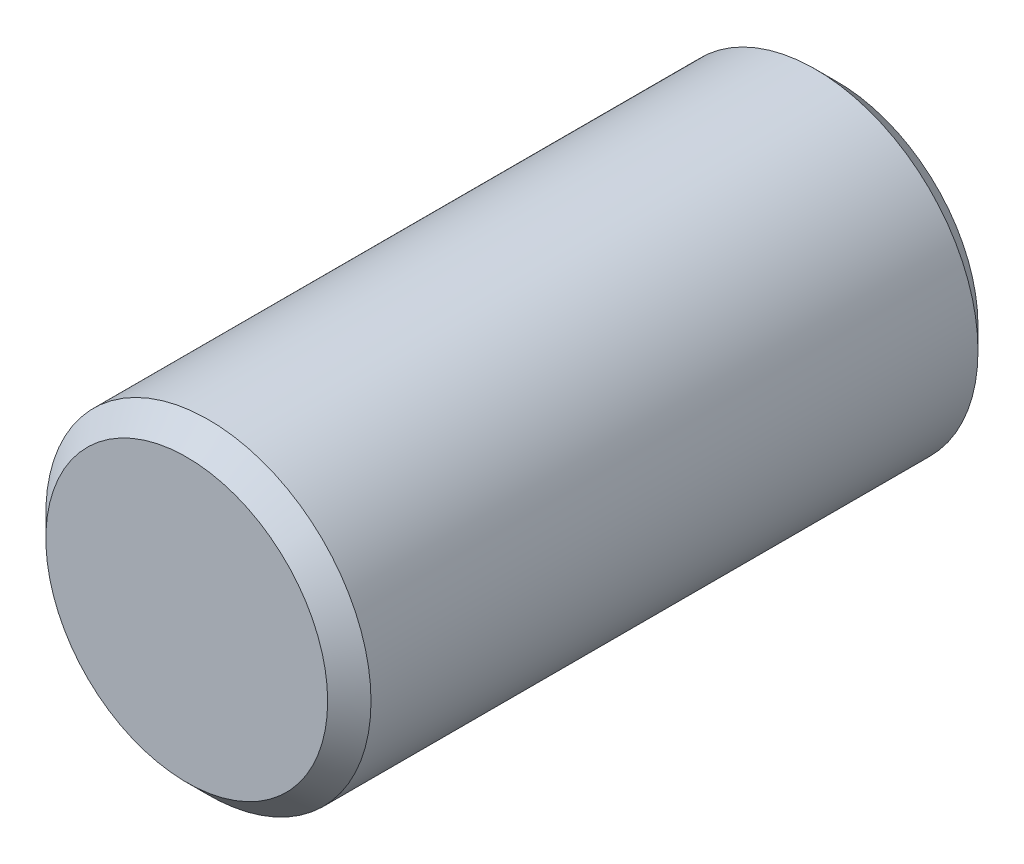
from build123d import *

# Parameters (mm, degrees)
ESQUISSE1_R      = 1.5
EXTRUSION1_DEPTH = 6
CHANFREIN1_SIZE  = 0.2


with BuildPart() as part:
    # Esquisse1 → Extrusion1 (new body)
    with BuildSketch(Plane.XY):
        Circle(ESQUISSE1_R)
    extrude(amount=EXTRUSION1_DEPTH)

    # Chanfrein1
    chanfrein1_edges = [part.edges().sort_by_distance(p)[0] for p in [
        (-1.5, 0, 0),
        (-1.5, 0, 6),
    ]]
    chamfer(chanfrein1_edges, length=CHANFREIN1_SIZE)


solid = part.part
